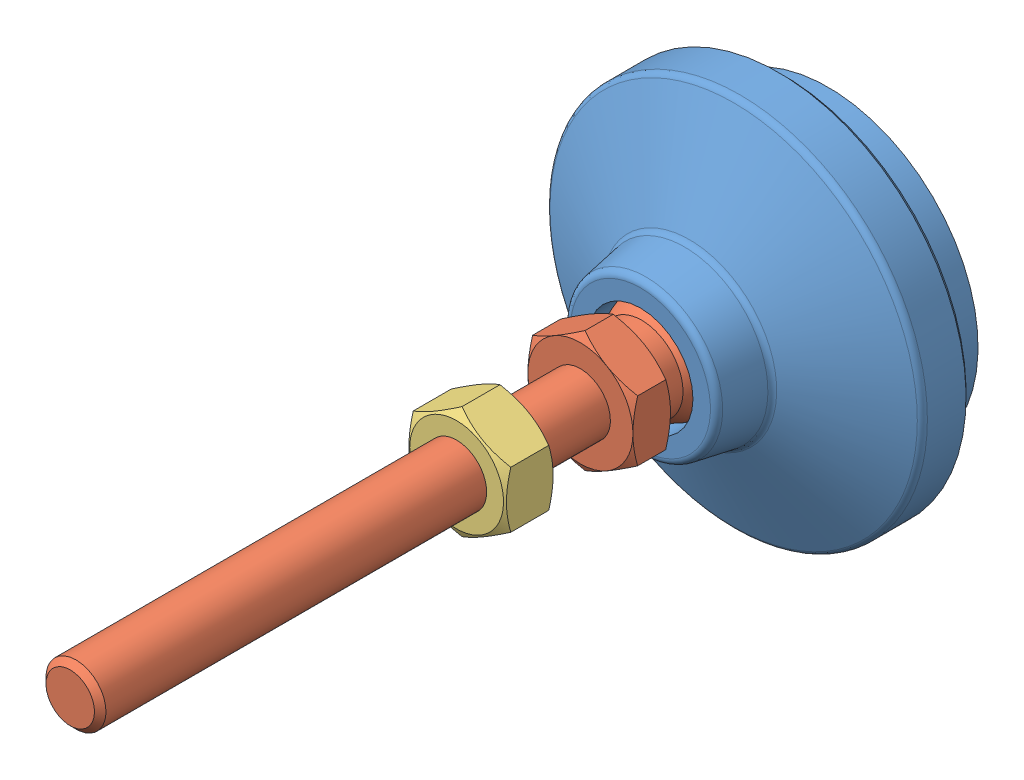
SolidWorks assembly LSVA50-M8X68.sldasm, configuration Default (file format 15000). Lengths in mm.
Overall size (50 50 101).
3 component instances, 3 part files, 0 mates.
Components (placement in the parent):
- LSVA50-M8X68_01-1: LSVA50-M8X68_01.SLDPRT [ﾃﾞﾌｫﾙﾄ] at (0 0 6) x (1 0 0) z (0 -1 0) size (50 25 50)
- LSVA50-M8X68_02-1: LSVA50-M8X68_02.SLDPRT [ﾃﾞﾌｫﾙﾄ] at (0 -0.0001 13.5) x (1 0 0) z (0 -1 0) size (14 87.5 16.17)
- LSVA50-M8X68_03-1: LSVA50-M8X68_03.SLDPRT [ﾃﾞﾌｫﾙﾄ] at (0 0 43) size (13 15.01 6.5)
